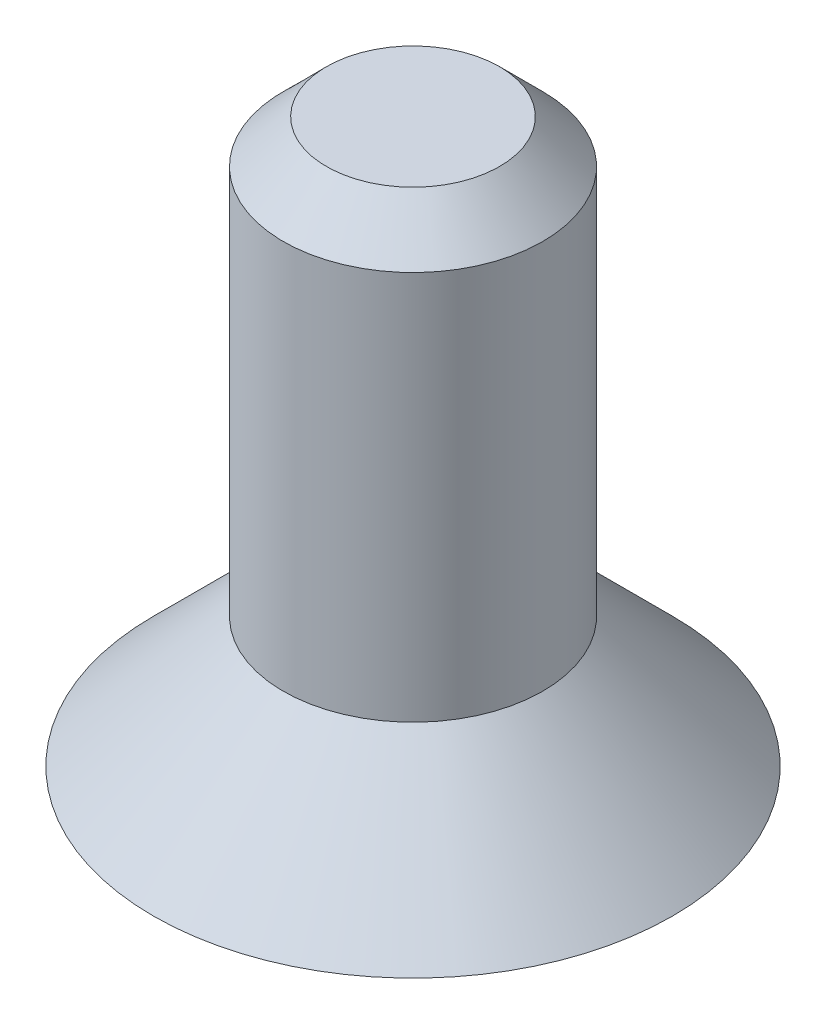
ISO-10303-21;
HEADER;
FILE_DESCRIPTION(('STEP AP214'),'2;1');
FILE_NAME('part.step','',(''),(''),'','','');
FILE_SCHEMA(('AUTOMOTIVE_DESIGN { 1 0 10303 214 1 1 1 1 }'));
ENDSEC;
DATA;
#1=APPLICATION_CONTEXT('core data for automotive mechanical design processes');
#2=APPLICATION_PROTOCOL_DEFINITION('international standard','automotive_design',2000,#1);
#3=PRODUCT_CONTEXT('',#1,'mechanical');
#4=PRODUCT('Part','Part','',(#3));
#5=PRODUCT_RELATED_PRODUCT_CATEGORY('part','',(#4));
#6=PRODUCT_DEFINITION_FORMATION('','',#4);
#7=PRODUCT_DEFINITION_CONTEXT('part definition',#1,'design');
#8=PRODUCT_DEFINITION('design','',#6,#7);
#9=PRODUCT_DEFINITION_SHAPE('','',#8);
#10=(LENGTH_UNIT() NAMED_UNIT(*) SI_UNIT(.MILLI.,.METRE.));
#11=(NAMED_UNIT(*) PLANE_ANGLE_UNIT() SI_UNIT($,.RADIAN.));
#12=(NAMED_UNIT(*) SI_UNIT($,.STERADIAN.) SOLID_ANGLE_UNIT());
#13=UNCERTAINTY_MEASURE_WITH_UNIT(LENGTH_MEASURE(1.E-05),#10,'distance_accuracy_value','');
#14=(GEOMETRIC_REPRESENTATION_CONTEXT(3) GLOBAL_UNCERTAINTY_ASSIGNED_CONTEXT((#13)) GLOBAL_UNIT_ASSIGNED_CONTEXT((#10,
#11,#12)) REPRESENTATION_CONTEXT('',''));
#15=CARTESIAN_POINT('',(0.,0.,0.));
#16=DIRECTION('',(0.,0.,1.));
#17=DIRECTION('',(1.,0.,0.));
#18=AXIS2_PLACEMENT_3D('',#15,#16,#17);
#19=CARTESIAN_POINT('',(2.17570116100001,-19.58,2.49074777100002));
#20=DIRECTION('',(0.,-1.,0.));
#21=DIRECTION('',(-0.990343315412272,0.,-0.138636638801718));
#22=AXIS2_PLACEMENT_3D('',#19,#20,#21);
#23=PLANE('',#22);
#24=DIRECTION('',(-0.990343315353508,0.,-0.138636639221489));
#25=VECTOR('',#24,1.);
#26=CARTESIAN_POINT('',(0.300157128,-19.58,-2.144156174));
#27=LINE('',#26,#25);
#28=CARTESIAN_POINT('',(1.53808627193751,-19.58,-1.970860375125));
#29=VERTEX_POINT('',#28);
#30=CARTESIAN_POINT('',(-0.937772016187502,-19.58,-2.31745197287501));
#31=VERTEX_POINT('',#30);
#32=EDGE_CURVE('E92',#29,#31,#27,.T.);
#33=ORIENTED_EDGE('',*,*,#32,.F.);
#34=DIRECTION('',(-0.37510880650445,0.,-0.92698078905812));
#35=VECTOR('',#34,1.);
#36=CARTESIAN_POINT('',(2.00697228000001,-19.58,-0.812134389));
#37=LINE('',#36,#35);
#38=CARTESIAN_POINT('',(2.4758582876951,-19.58,0.346591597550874));
#39=VERTEX_POINT('',#38);
#40=EDGE_CURVE('E78',#39,#29,#37,.T.);
#41=ORIENTED_EDGE('',*,*,#40,.F.);
#42=DIRECTION('',(0.615234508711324,0.,-0.788344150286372));
#43=VECTOR('',#42,1.);
#44=CARTESIAN_POINT('',(1.70681515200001,-19.58,1.33202178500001));
#45=LINE('',#44,#43);
#46=CARTESIAN_POINT('',(0.937772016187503,-19.58,2.31745197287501));
#47=VERTEX_POINT('',#46);
#48=EDGE_CURVE('E76',#47,#39,#45,.T.);
#49=ORIENTED_EDGE('',*,*,#48,.F.);
#50=DIRECTION('',(0.990343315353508,0.,0.138636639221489));
#51=VECTOR('',#50,1.);
#52=CARTESIAN_POINT('',(-0.300157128,-19.58,2.14415617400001));
#53=LINE('',#52,#51);
#54=CARTESIAN_POINT('',(-1.538086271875,-19.58,1.97086037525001));
#55=VERTEX_POINT('',#54);
#56=EDGE_CURVE('E67',#55,#47,#53,.T.);
#57=ORIENTED_EDGE('',*,*,#56,.F.);
#58=DIRECTION('',(0.37510880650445,0.,0.92698078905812));
#59=VECTOR('',#58,1.);
#60=CARTESIAN_POINT('',(-2.00697228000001,-19.58,0.812134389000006));
#61=LINE('',#60,#59);
#62=CARTESIAN_POINT('',(-2.47585828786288,-19.58,-0.346591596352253));
#63=VERTEX_POINT('',#62);
#64=EDGE_CURVE('E110',#63,#55,#61,.T.);
#65=ORIENTED_EDGE('',*,*,#64,.F.);
#66=DIRECTION('',(-0.615234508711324,0.,0.788344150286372));
#67=VECTOR('',#66,1.);
#68=CARTESIAN_POINT('',(-1.70681515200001,-19.58,-1.332021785));
#69=LINE('',#68,#67);
#70=EDGE_CURVE('E112',#31,#63,#69,.T.);
#71=ORIENTED_EDGE('',*,*,#70,.F.);
#72=EDGE_LOOP('',(#33,#41,#49,#57,#65,#71));
#73=FACE_BOUND('',#72,.T.);
#74=ADVANCED_FACE('F10',(#73),#23,.T.);
#75=CARTESIAN_POINT('',(-1.53808627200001,-22.,1.97086037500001));
#76=DIRECTION('',(0.138636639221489,0.,-0.990343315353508));
#77=DIRECTION('',(0.,1.,0.));
#78=AXIS2_PLACEMENT_3D('',#75,#76,#77);
#79=PLANE('',#78);
#80=ORIENTED_EDGE('',*,*,#56,.T.);
#81=DIRECTION('',(0.,1.,0.));
#82=VECTOR('',#81,1.);
#83=CARTESIAN_POINT('',(0.937772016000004,-20.79,2.31745197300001));
#84=LINE('',#83,#82);
#85=CARTESIAN_POINT('',(0.937772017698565,-22.,2.31745197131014));
#86=VERTEX_POINT('',#85);
#87=EDGE_CURVE('E44',#86,#47,#84,.T.);
#88=ORIENTED_EDGE('',*,*,#87,.F.);
#89=DIRECTION('',(0.990343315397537,0.,0.138636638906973));
#90=VECTOR('',#89,1.);
#91=CARTESIAN_POINT('',(-0.300157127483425,-22.,2.1441561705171));
#92=LINE('',#91,#90);
#93=CARTESIAN_POINT('',(-1.53808627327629,-22.,1.97086037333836));
#94=VERTEX_POINT('',#93);
#95=EDGE_CURVE('E50',#94,#86,#92,.T.);
#96=ORIENTED_EDGE('',*,*,#95,.F.);
#97=DIRECTION('',(0.,-1.,0.));
#98=VECTOR('',#97,1.);
#99=CARTESIAN_POINT('',(-1.53808627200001,-20.79,1.97086037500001));
#100=LINE('',#99,#98);
#101=EDGE_CURVE('E70',#55,#94,#100,.T.);
#102=ORIENTED_EDGE('',*,*,#101,.F.);
#103=EDGE_LOOP('',(#80,#88,#96,#102));
#104=FACE_BOUND('',#103,.T.);
#105=ADVANCED_FACE('F69',(#104),#79,.T.);
#106=CARTESIAN_POINT('',(2.47585828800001,-22.,0.346591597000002));
#107=DIRECTION('',(-0.788344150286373,0.,-0.615234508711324));
#108=DIRECTION('',(-0.615234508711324,0.,0.788344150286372));
#109=AXIS2_PLACEMENT_3D('',#106,#107,#108);
#110=PLANE('',#109);
#111=ORIENTED_EDGE('',*,*,#48,.T.);
#112=DIRECTION('',(0.,1.,0.));
#113=VECTOR('',#112,1.);
#114=CARTESIAN_POINT('',(2.47585828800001,-20.79,0.346591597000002));
#115=LINE('',#114,#113);
#116=CARTESIAN_POINT('',(2.47585829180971,-22.,0.346591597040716));
#117=VERTEX_POINT('',#116);
#118=EDGE_CURVE('E81',#117,#39,#115,.T.);
#119=ORIENTED_EDGE('',*,*,#118,.F.);
#120=DIRECTION('',(0.615234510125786,0.,-0.788344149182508));
#121=VECTOR('',#120,1.);
#122=CARTESIAN_POINT('',(0.937772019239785,-22.,2.31745196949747));
#123=LINE('',#122,#121);
#124=EDGE_CURVE('E14',#86,#117,#123,.T.);
#125=ORIENTED_EDGE('',*,*,#124,.F.);
#126=ORIENTED_EDGE('',*,*,#87,.T.);
#127=EDGE_LOOP('',(#111,#119,#125,#126));
#128=FACE_BOUND('',#127,.T.);
#129=ADVANCED_FACE('F83',(#128),#110,.T.);
#130=CARTESIAN_POINT('',(1.53808627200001,-22.,-1.970860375));
#131=DIRECTION('',(-0.92698078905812,0.,0.37510880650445));
#132=DIRECTION('',(0.37510880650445,0.,0.92698078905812));
#133=AXIS2_PLACEMENT_3D('',#130,#131,#132);
#134=PLANE('',#133);
#135=ORIENTED_EDGE('',*,*,#40,.T.);
#136=DIRECTION('',(0.,1.,0.));
#137=VECTOR('',#136,1.);
#138=CARTESIAN_POINT('',(1.538086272,-20.79,-1.97086037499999));
#139=LINE('',#138,#137);
#140=CARTESIAN_POINT('',(1.53808627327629,-22.,-1.97086037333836));
#141=VERTEX_POINT('',#140);
#142=EDGE_CURVE('E90',#141,#29,#139,.T.);
#143=ORIENTED_EDGE('',*,*,#142,.F.);
#144=DIRECTION('',(-0.37510880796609,0.,-0.926980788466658));
#145=VECTOR('',#144,1.);
#146=CARTESIAN_POINT('',(2.47585829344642,-22.,0.346591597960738));
#147=LINE('',#146,#145);
#148=EDGE_CURVE('E104',#117,#141,#147,.T.);
#149=ORIENTED_EDGE('',*,*,#148,.F.);
#150=ORIENTED_EDGE('',*,*,#118,.T.);
#151=EDGE_LOOP('',(#135,#143,#149,#150));
#152=FACE_BOUND('',#151,.T.);
#153=ADVANCED_FACE('F125',(#152),#134,.T.);
#154=CARTESIAN_POINT('',(-0.937772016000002,-19.58,-2.317451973));
#155=DIRECTION('',(-0.138636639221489,0.,0.990343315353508));
#156=DIRECTION('',(0.,-1.,0.));
#157=AXIS2_PLACEMENT_3D('',#154,#155,#156);
#158=PLANE('',#157);
#159=ORIENTED_EDGE('',*,*,#32,.T.);
#160=DIRECTION('',(0.,1.,0.));
#161=VECTOR('',#160,1.);
#162=CARTESIAN_POINT('',(-0.937772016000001,-20.79,-2.317451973));
#163=LINE('',#162,#161);
#164=CARTESIAN_POINT('',(-0.937772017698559,-22.,-2.31745197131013));
#165=VERTEX_POINT('',#164);
#166=EDGE_CURVE('E114',#165,#31,#163,.T.);
#167=ORIENTED_EDGE('',*,*,#166,.F.);
#168=DIRECTION('',(-0.990343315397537,0.,-0.138636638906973));
#169=VECTOR('',#168,1.);
#170=CARTESIAN_POINT('',(0.300157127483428,-22.,-2.14415617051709));
#171=LINE('',#170,#169);
#172=EDGE_CURVE('E103',#141,#165,#171,.T.);
#173=ORIENTED_EDGE('',*,*,#172,.F.);
#174=ORIENTED_EDGE('',*,*,#142,.T.);
#175=EDGE_LOOP('',(#159,#167,#173,#174));
#176=FACE_BOUND('',#175,.T.);
#177=ADVANCED_FACE('F129',(#176),#158,.T.);
#178=CARTESIAN_POINT('',(-2.47585828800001,-22.,-0.346591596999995));
#179=DIRECTION('',(0.788344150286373,0.,0.615234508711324));
#180=DIRECTION('',(0.615234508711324,0.,-0.788344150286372));
#181=AXIS2_PLACEMENT_3D('',#178,#179,#180);
#182=PLANE('',#181);
#183=ORIENTED_EDGE('',*,*,#70,.T.);
#184=DIRECTION('',(0.,1.,0.));
#185=VECTOR('',#184,1.);
#186=CARTESIAN_POINT('',(-2.47585828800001,-20.79,-0.346591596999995));
#187=LINE('',#186,#185);
#188=CARTESIAN_POINT('',(-2.47585829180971,-22.,-0.346591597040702));
#189=VERTEX_POINT('',#188);
#190=EDGE_CURVE('E29',#189,#63,#187,.T.);
#191=ORIENTED_EDGE('',*,*,#190,.F.);
#192=DIRECTION('',(-0.615234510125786,0.,0.788344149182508));
#193=VECTOR('',#192,1.);
#194=CARTESIAN_POINT('',(-0.93777201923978,-22.,-2.31745196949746));
#195=LINE('',#194,#193);
#196=EDGE_CURVE('E101',#165,#189,#195,.T.);
#197=ORIENTED_EDGE('',*,*,#196,.F.);
#198=ORIENTED_EDGE('',*,*,#166,.T.);
#199=EDGE_LOOP('',(#183,#191,#197,#198));
#200=FACE_BOUND('',#199,.T.);
#201=ADVANCED_FACE('F132',(#200),#182,.T.);
#202=CARTESIAN_POINT('',(-1.53808627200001,-22.,1.97086037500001));
#203=DIRECTION('',(0.92698078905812,0.,-0.37510880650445));
#204=DIRECTION('',(-0.37510880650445,0.,-0.92698078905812));
#205=AXIS2_PLACEMENT_3D('',#202,#203,#204);
#206=PLANE('',#205);
#207=ORIENTED_EDGE('',*,*,#64,.T.);
#208=ORIENTED_EDGE('',*,*,#101,.T.);
#209=DIRECTION('',(0.375108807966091,0.,0.926980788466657));
#210=VECTOR('',#209,1.);
#211=CARTESIAN_POINT('',(-2.47585829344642,-22.,-0.346591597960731));
#212=LINE('',#211,#210);
#213=EDGE_CURVE('E98',#189,#94,#212,.T.);
#214=ORIENTED_EDGE('',*,*,#213,.F.);
#215=ORIENTED_EDGE('',*,*,#190,.T.);
#216=EDGE_LOOP('',(#207,#208,#214,#215));
#217=FACE_BOUND('',#216,.T.);
#218=ADVANCED_FACE('F134',(#217),#206,.T.);
#219=CARTESIAN_POINT('',(5.17156294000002,-22.,6.85516628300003));
#220=DIRECTION('',(0.,-1.,0.));
#221=DIRECTION('',(-0.990343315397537,0.,-0.138636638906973));
#222=AXIS2_PLACEMENT_3D('',#219,#220,#221);
#223=PLANE('',#222);
#224=ORIENTED_EDGE('',*,*,#196,.T.);
#225=ORIENTED_EDGE('',*,*,#213,.T.);
#226=ORIENTED_EDGE('',*,*,#95,.T.);
#227=ORIENTED_EDGE('',*,*,#124,.T.);
#228=ORIENTED_EDGE('',*,*,#148,.T.);
#229=ORIENTED_EDGE('',*,*,#172,.T.);
#230=EDGE_LOOP('',(#224,#225,#226,#227,#228,#229));
#231=FACE_BOUND('',#230,.T.);
#232=CARTESIAN_POINT('',(0.,-22.,0.));
#233=DIRECTION('',(0.,-1.,0.));
#234=DIRECTION('',(0.,0.,-1.));
#235=AXIS2_PLACEMENT_3D('',#232,#233,#234);
#236=CIRCLE('',#235,5.99999999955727);
#237=CARTESIAN_POINT('',(0.,-22.,-5.99999999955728));
#238=VERTEX_POINT('',#237);
#239=EDGE_CURVE('E94',#238,#238,#236,.T.);
#240=ORIENTED_EDGE('',*,*,#239,.T.);
#241=EDGE_LOOP('',(#240));
#242=FACE_BOUND('',#241,.T.);
#243=ADVANCED_FACE('F130',(#231,#242),#223,.T.);
#244=CARTESIAN_POINT('',(0.,-19.,0.));
#245=DIRECTION('',(0.,-1.,0.));
#246=DIRECTION('',(0.,0.,-1.));
#247=AXIS2_PLACEMENT_3D('',#244,#245,#246);
#248=CONICAL_SURFACE('',#247,2.99999999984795,0.785398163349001);
#249=ORIENTED_EDGE('',*,*,#239,.F.);
#250=EDGE_LOOP('',(#249));
#251=FACE_BOUND('',#250,.T.);
#252=CARTESIAN_POINT('',(0.,-19.,0.));
#253=DIRECTION('',(0.,-1.,0.));
#254=DIRECTION('',(-0.99034331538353,0.,-0.138636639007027));
#255=AXIS2_PLACEMENT_3D('',#252,#253,#254);
#256=CIRCLE('',#255,2.99999999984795);
#257=CARTESIAN_POINT('',(-2.97102994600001,-19.,-0.415909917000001));
#258=VERTEX_POINT('',#257);
#259=EDGE_CURVE('E97',#258,#258,#256,.T.);
#260=ORIENTED_EDGE('',*,*,#259,.T.);
#261=EDGE_LOOP('',(#260));
#262=FACE_BOUND('',#261,.T.);
#263=ADVANCED_FACE('F136',(#251,#262),#248,.T.);
#264=CARTESIAN_POINT('',(0.,-10.,0.));
#265=DIRECTION('',(0.,-1.,0.));
#266=DIRECTION('',(0.,0.,-1.));
#267=AXIS2_PLACEMENT_3D('',#264,#265,#266);
#268=CYLINDRICAL_SURFACE('',#267,2.99999999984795);
#269=ORIENTED_EDGE('',*,*,#259,.F.);
#270=EDGE_LOOP('',(#269));
#271=FACE_BOUND('',#270,.T.);
#272=CARTESIAN_POINT('',(0.,-10.,0.));
#273=DIRECTION('',(0.,-1.,0.));
#274=DIRECTION('',(-0.99034331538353,0.,-0.138636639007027));
#275=AXIS2_PLACEMENT_3D('',#272,#273,#274);
#276=CIRCLE('',#275,2.99999999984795);
#277=CARTESIAN_POINT('',(-2.97102994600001,-10.,-0.415909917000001));
#278=VERTEX_POINT('',#277);
#279=EDGE_CURVE('E20',#278,#278,#276,.T.);
#280=ORIENTED_EDGE('',*,*,#279,.T.);
#281=EDGE_LOOP('',(#280));
#282=FACE_BOUND('',#281,.T.);
#283=ADVANCED_FACE('F141',(#271,#282),#268,.T.);
#284=CARTESIAN_POINT('',(-2.28505542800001,-9.,1.72385431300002));
#285=DIRECTION('',(0.,1.,0.));
#286=DIRECTION('',(0.990343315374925,0.,0.138636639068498));
#287=AXIS2_PLACEMENT_3D('',#284,#285,#286);
#288=PLANE('',#287);
#289=CARTESIAN_POINT('',(0.,-9.,0.));
#290=DIRECTION('',(0.,-1.,0.));
#291=DIRECTION('',(0.,0.,-1.));
#292=AXIS2_PLACEMENT_3D('',#289,#290,#291);
#293=CIRCLE('',#292,2.00000000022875);
#294=CARTESIAN_POINT('',(0.,-9.,-2.00000000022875));
#295=VERTEX_POINT('',#294);
#296=EDGE_CURVE('E8',#295,#295,#293,.F.);
#297=ORIENTED_EDGE('',*,*,#296,.T.);
#298=EDGE_LOOP('',(#297));
#299=FACE_BOUND('',#298,.T.);
#300=ADVANCED_FACE('F12',(#299),#288,.T.);
#301=CARTESIAN_POINT('',(0.,-9.,0.));
#302=DIRECTION('',(0.,-1.,0.));
#303=DIRECTION('',(0.,0.,-1.));
#304=AXIS2_PLACEMENT_3D('',#301,#302,#303);
#305=CONICAL_SURFACE('',#304,2.00000000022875,0.78539816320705);
#306=ORIENTED_EDGE('',*,*,#296,.F.);
#307=EDGE_LOOP('',(#306));
#308=FACE_BOUND('',#307,.T.);
#309=ORIENTED_EDGE('',*,*,#279,.F.);
#310=EDGE_LOOP('',(#309));
#311=FACE_BOUND('',#310,.T.);
#312=ADVANCED_FACE('F138',(#308,#311),#305,.T.);
#313=CLOSED_SHELL('',(#74,#105,#129,#153,#177,#201,#218,#243,#263,#283,#300,#312));
#314=MANIFOLD_SOLID_BREP('B1',#313);
#315=ADVANCED_BREP_SHAPE_REPRESENTATION('',(#18,#314),#14);
#316=SHAPE_DEFINITION_REPRESENTATION(#9,#315);
ENDSEC;
END-ISO-10303-21;
